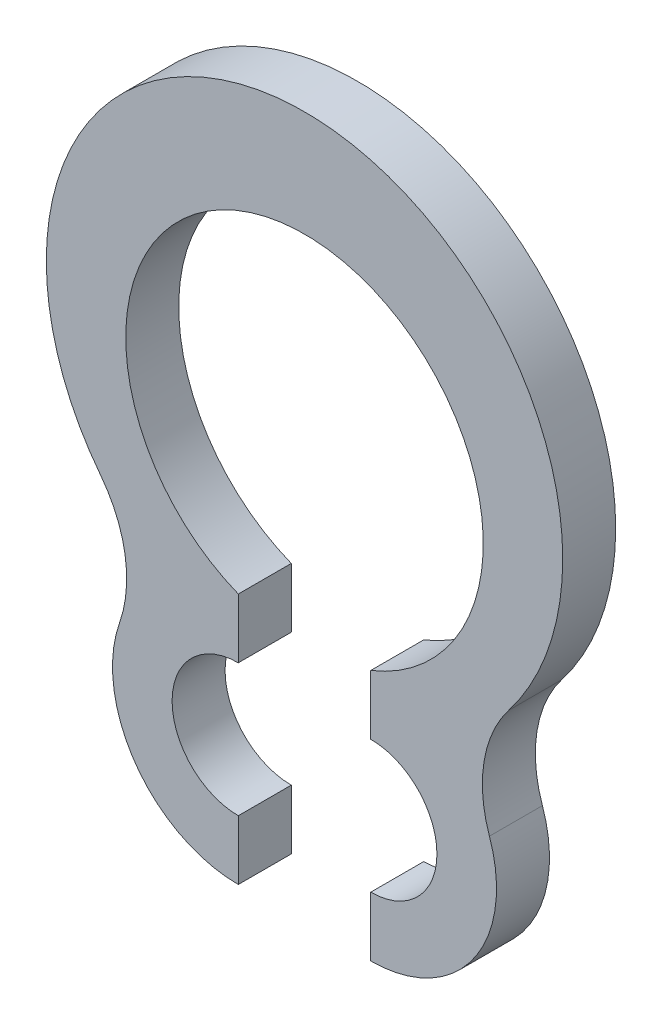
from build123d import *

# Parameters (mm, degrees)
BODY_DEPTH = 0.4


with BuildPart() as part:
    # Sketch1 → Body (new body)
    with BuildSketch(Plane.XY):
        with BuildLine():
            Line((-0.5, -1.45399362), (-0.5, -1.90399362))
            ThreePointArc((-0.5, -1.90399362), (-1, -2.40399362), (-0.5, -2.90399362))
            Line((-0.5, -2.90399362), (-0.5, -3.35399362))
            ThreePointArc((-0.5, -3.35399362), (-1.274943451, -2.953504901), (-1.396505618, -2.089704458))
            ThreePointArc((-1.396505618, -2.089704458), (-1.355272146, -1.623279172), (-1.541852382, -1.193813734))
            ThreePointArc((-1.541852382, -1.193813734), (0, 1.95), (1.541852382, -1.193813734))
            ThreePointArc((1.541852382, -1.193813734), (1.355272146, -1.623279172), (1.396505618, -2.089704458))
            ThreePointArc((1.396505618, -2.089704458), (1.274943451, -2.953504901), (0.5, -3.35399362))
            Line((0.5, -3.35399362), (0.5, -2.90399362))
            ThreePointArc((0.5, -2.90399362), (1, -2.40399362), (0.5, -1.90399362))
            Line((0.5, -1.90399362), (0.5, -1.45399362))
            ThreePointArc((0.5, -1.45399362), (0, 1.15), (-0.5, -1.45399362))
        make_face()
    extrude(amount=-BODY_DEPTH)


solid = part.part
